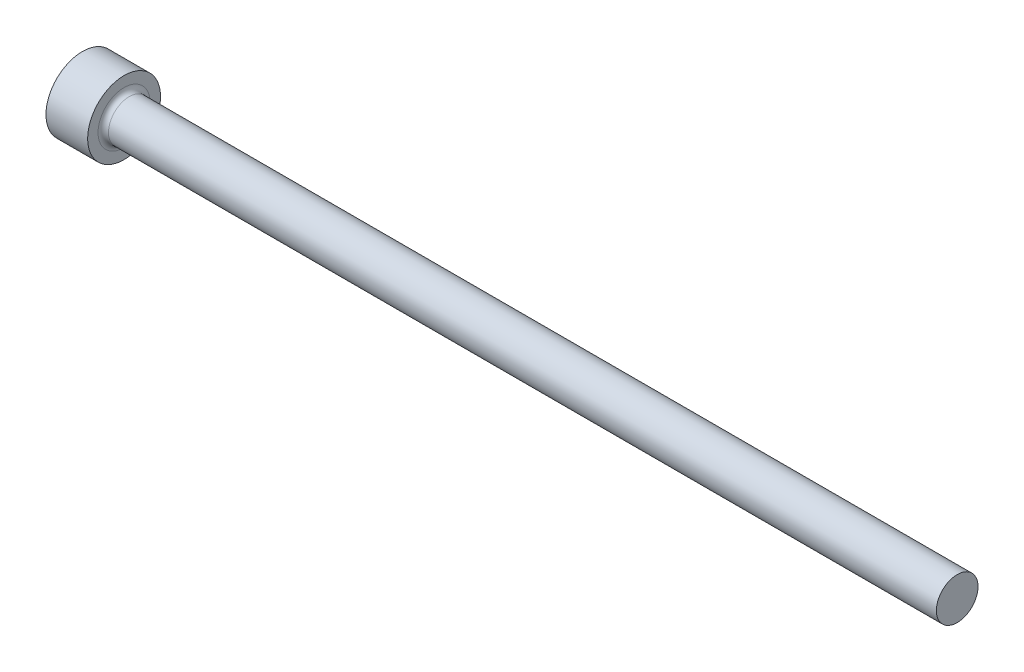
from build123d import *


with BuildPart() as part:
    # Sketch1 → Base-Revolve (revolve)
    with BuildSketch(Plane.XY):
        with BuildLine():
            Line((-6.35, 0), (-6.35, 5.55625))
            Line((-6.35, 5.55625), (0, 5.55625))
            Line((0, 5.55625), (0, 3.96875))
            ThreePointArc((0, 3.96875), (0.232483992, 3.407483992), (0.79375, 3.175))
            Line((0.79375, 3.175), (127, 3.175))
            Line((127, 3.175), (127, 0))
            Line((127, 0), (-6.35, 0))
        make_face()
    revolve(axis=Axis((127, 0, 0), (-1, 0, 0)))


solid = part.part
